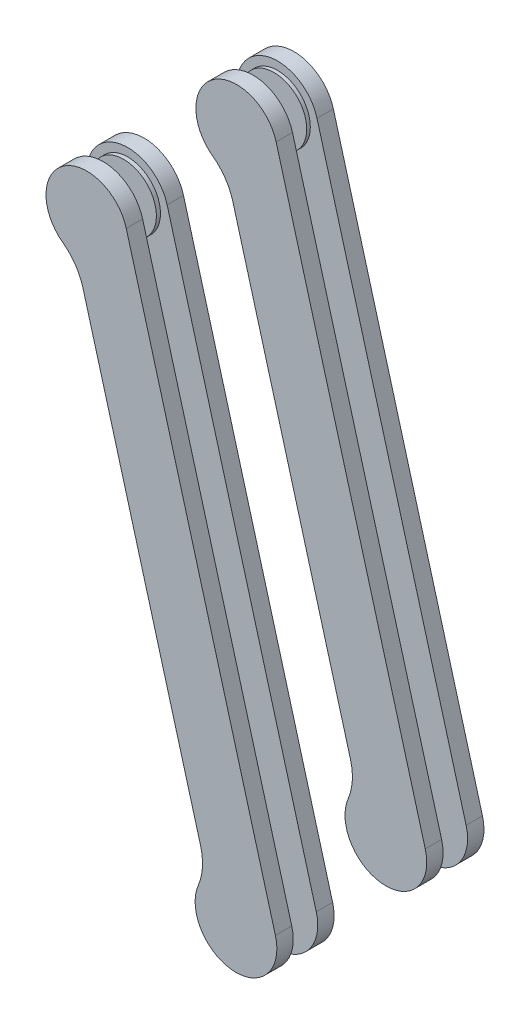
ISO-10303-21;
HEADER;
FILE_DESCRIPTION(('STEP AP214'),'2;1');
FILE_NAME('part.step','',(''),(''),'','','');
FILE_SCHEMA(('AUTOMOTIVE_DESIGN { 1 0 10303 214 1 1 1 1 }'));
ENDSEC;
DATA;
#1=APPLICATION_CONTEXT('core data for automotive mechanical design processes');
#2=APPLICATION_PROTOCOL_DEFINITION('international standard','automotive_design',2000,#1);
#3=PRODUCT_CONTEXT('',#1,'mechanical');
#4=PRODUCT('Part','Part','',(#3));
#5=PRODUCT_RELATED_PRODUCT_CATEGORY('part','',(#4));
#6=PRODUCT_DEFINITION_FORMATION('','',#4);
#7=PRODUCT_DEFINITION_CONTEXT('part definition',#1,'design');
#8=PRODUCT_DEFINITION('design','',#6,#7);
#9=PRODUCT_DEFINITION_SHAPE('','',#8);
#10=(LENGTH_UNIT() NAMED_UNIT(*) SI_UNIT(.MILLI.,.METRE.));
#11=(NAMED_UNIT(*) PLANE_ANGLE_UNIT() SI_UNIT($,.RADIAN.));
#12=(NAMED_UNIT(*) SI_UNIT($,.STERADIAN.) SOLID_ANGLE_UNIT());
#13=UNCERTAINTY_MEASURE_WITH_UNIT(LENGTH_MEASURE(1.E-05),#10,'distance_accuracy_value','');
#14=(GEOMETRIC_REPRESENTATION_CONTEXT(3) GLOBAL_UNCERTAINTY_ASSIGNED_CONTEXT((#13)) GLOBAL_UNIT_ASSIGNED_CONTEXT((#10,
#11,#12)) REPRESENTATION_CONTEXT('',''));
#15=CARTESIAN_POINT('',(0.,0.,0.));
#16=DIRECTION('',(0.,0.,1.));
#17=DIRECTION('',(1.,0.,0.));
#18=AXIS2_PLACEMENT_3D('',#15,#16,#17);
#19=CARTESIAN_POINT('',(189.457124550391,500.064001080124,22.9999999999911));
#20=DIRECTION('',(0.,0.,-1.));
#21=DIRECTION('',(-1.,0.,0.));
#22=AXIS2_PLACEMENT_3D('',#19,#20,#21);
#23=PLANE('',#22);
#24=CARTESIAN_POINT('',(189.457124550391,500.064001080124,22.9999999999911));
#25=DIRECTION('',(0.,0.,1.));
#26=DIRECTION('',(1.,0.,0.));
#27=AXIS2_PLACEMENT_3D('',#24,#25,#26);
#28=CIRCLE('',#27,12.0000004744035);
#29=CARTESIAN_POINT('',(201.457125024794,500.064001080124,22.9999999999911));
#30=VERTEX_POINT('',#29);
#31=EDGE_CURVE('P0_E10',#30,#30,#28,.T.);
#32=ORIENTED_EDGE('',*,*,#31,.F.);
#33=EDGE_LOOP('',(#32));
#34=FACE_BOUND('',#33,.T.);
#35=ADVANCED_FACE('P0_F14',(#34),#23,.T.);
#36=CARTESIAN_POINT('',(189.457124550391,500.064001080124,24.4999999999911));
#37=DIRECTION('',(0.,0.,1.));
#38=DIRECTION('',(1.,0.,0.));
#39=AXIS2_PLACEMENT_3D('',#36,#37,#38);
#40=PLANE('',#39);
#41=CARTESIAN_POINT('',(189.457124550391,500.064001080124,24.4999999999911));
#42=DIRECTION('',(0.,0.,-1.));
#43=DIRECTION('',(-1.,0.,0.));
#44=AXIS2_PLACEMENT_3D('',#41,#42,#43);
#45=CIRCLE('',#44,12.0000004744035);
#46=CARTESIAN_POINT('',(177.457124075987,500.064001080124,24.4999999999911));
#47=VERTEX_POINT('',#46);
#48=EDGE_CURVE('P0_E21',#47,#47,#45,.T.);
#49=ORIENTED_EDGE('',*,*,#48,.F.);
#50=EDGE_LOOP('',(#49));
#51=FACE_BOUND('',#50,.T.);
#52=ADVANCED_FACE('P0_F28',(#51),#40,.T.);
#53=CARTESIAN_POINT('',(189.457124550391,500.064001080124,24.4999999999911));
#54=DIRECTION('',(0.,0.,-1.));
#55=DIRECTION('',(-1.,0.,0.));
#56=AXIS2_PLACEMENT_3D('',#53,#54,#55);
#57=CYLINDRICAL_SURFACE('',#56,12.0000004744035);
#58=ORIENTED_EDGE('',*,*,#31,.T.);
#59=EDGE_LOOP('',(#58));
#60=FACE_BOUND('',#59,.T.);
#61=ORIENTED_EDGE('',*,*,#48,.T.);
#62=EDGE_LOOP('',(#61));
#63=FACE_BOUND('',#62,.T.);
#64=ADVANCED_FACE('P0_F16',(#60,#63),#57,.T.);
#65=CLOSED_SHELL('',(#35,#52,#64));
#66=MANIFOLD_SOLID_BREP('P0_B1',#65);
#67=CARTESIAN_POINT('',(189.457124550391,500.064001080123,-30.6777586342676));
#68=DIRECTION('',(0.,0.,1.));
#69=DIRECTION('',(1.,0.,0.));
#70=AXIS2_PLACEMENT_3D('',#67,#68,#69);
#71=PLANE('',#70);
#72=CARTESIAN_POINT('',(189.457124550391,500.064001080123,-30.6777586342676));
#73=DIRECTION('',(0.,0.,-1.));
#74=DIRECTION('',(-1.,0.,0.));
#75=AXIS2_PLACEMENT_3D('',#72,#73,#74);
#76=CIRCLE('',#75,12.0000004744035);
#77=CARTESIAN_POINT('',(177.457124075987,500.064001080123,-30.6777586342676));
#78=VERTEX_POINT('',#77);
#79=EDGE_CURVE('P1_E10',#78,#78,#76,.T.);
#80=ORIENTED_EDGE('',*,*,#79,.F.);
#81=EDGE_LOOP('',(#80));
#82=FACE_BOUND('',#81,.T.);
#83=ADVANCED_FACE('P1_F14',(#82),#71,.T.);
#84=CARTESIAN_POINT('',(189.457124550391,500.064001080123,-32.1777586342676));
#85=DIRECTION('',(0.,0.,-1.));
#86=DIRECTION('',(-1.,0.,0.));
#87=AXIS2_PLACEMENT_3D('',#84,#85,#86);
#88=PLANE('',#87);
#89=CARTESIAN_POINT('',(189.457124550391,500.064001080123,-32.1777586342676));
#90=DIRECTION('',(0.,0.,1.));
#91=DIRECTION('',(1.,0.,0.));
#92=AXIS2_PLACEMENT_3D('',#89,#90,#91);
#93=CIRCLE('',#92,12.0000004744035);
#94=CARTESIAN_POINT('',(201.457125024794,500.064001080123,-32.1777586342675));
#95=VERTEX_POINT('',#94);
#96=EDGE_CURVE('P1_E21',#95,#95,#93,.T.);
#97=ORIENTED_EDGE('',*,*,#96,.F.);
#98=EDGE_LOOP('',(#97));
#99=FACE_BOUND('',#98,.T.);
#100=ADVANCED_FACE('P1_F28',(#99),#88,.T.);
#101=CARTESIAN_POINT('',(189.457124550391,500.064001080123,-32.1777586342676));
#102=DIRECTION('',(0.,0.,1.));
#103=DIRECTION('',(1.,0.,0.));
#104=AXIS2_PLACEMENT_3D('',#101,#102,#103);
#105=CYLINDRICAL_SURFACE('',#104,12.0000004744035);
#106=ORIENTED_EDGE('',*,*,#79,.T.);
#107=EDGE_LOOP('',(#106));
#108=FACE_BOUND('',#107,.T.);
#109=ORIENTED_EDGE('',*,*,#96,.T.);
#110=EDGE_LOOP('',(#109));
#111=FACE_BOUND('',#110,.T.);
#112=ADVANCED_FACE('P1_F16',(#108,#111),#105,.T.);
#113=CLOSED_SHELL('',(#83,#100,#112));
#114=MANIFOLD_SOLID_BREP('P1_B1',#113);
#115=CARTESIAN_POINT('',(258.640039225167,306.734149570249,16.9999993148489));
#116=DIRECTION('',(0.963628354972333,0.267245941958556,-2.71115585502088E-13));
#117=DIRECTION('',(-0.267245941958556,0.963628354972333,0.));
#118=AXIS2_PLACEMENT_3D('',#115,#116,#117);
#119=PLANE('',#118);
#120=DIRECTION('',(-0.267245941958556,0.963628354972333,0.));
#121=VECTOR('',#120,1.);
#122=CARTESIAN_POINT('',(258.640039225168,306.734149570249,22.9999993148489));
#123=LINE('',#122,#121);
#124=CARTESIAN_POINT('',(258.640039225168,306.734149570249,22.9999993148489));
#125=VERTEX_POINT('',#124);
#126=CARTESIAN_POINT('',(203.911549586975,504.072691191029,22.9999993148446));
#127=VERTEX_POINT('',#126);
#128=EDGE_CURVE('P2_E110',#125,#127,#123,.T.);
#129=ORIENTED_EDGE('',*,*,#128,.F.);
#130=DIRECTION('',(2.55680513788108E-13,0.,1.));
#131=VECTOR('',#130,1.);
#132=CARTESIAN_POINT('',(258.640039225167,306.734149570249,16.9999993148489));
#133=LINE('',#132,#131);
#134=CARTESIAN_POINT('',(258.640039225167,306.734149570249,16.9999993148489));
#135=VERTEX_POINT('',#134);
#136=EDGE_CURVE('P2_E55',#135,#125,#133,.T.);
#137=ORIENTED_EDGE('',*,*,#136,.F.);
#138=DIRECTION('',(-0.267245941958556,0.963628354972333,0.));
#139=VECTOR('',#138,1.);
#140=CARTESIAN_POINT('',(258.640039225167,306.734149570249,16.9999993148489));
#141=LINE('',#140,#139);
#142=CARTESIAN_POINT('',(203.911549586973,504.072691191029,16.9999993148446));
#143=VERTEX_POINT('',#142);
#144=EDGE_CURVE('P2_E94',#135,#143,#141,.T.);
#145=ORIENTED_EDGE('',*,*,#144,.T.);
#146=DIRECTION('',(2.55680513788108E-13,0.,1.));
#147=VECTOR('',#146,1.);
#148=CARTESIAN_POINT('',(203.911549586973,504.072691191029,16.9999993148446));
#149=LINE('',#148,#147);
#150=EDGE_CURVE('P2_E11',#143,#127,#149,.T.);
#151=ORIENTED_EDGE('',*,*,#150,.T.);
#152=EDGE_LOOP('',(#129,#137,#145,#151));
#153=FACE_BOUND('',#152,.T.);
#154=ADVANCED_FACE('P2_F16',(#153),#119,.T.);
#155=CARTESIAN_POINT('',(189.457124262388,500.064002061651,16.9999993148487));
#156=DIRECTION('',(2.55680513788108E-13,0.,1.));
#157=DIRECTION('',(1.,0.,-2.55680513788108E-13));
#158=AXIS2_PLACEMENT_3D('',#155,#156,#157);
#159=CYLINDRICAL_SURFACE('',#158,15.);
#160=CARTESIAN_POINT('',(189.45712426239,500.064002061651,22.9999993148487));
#161=DIRECTION('',(2.55680513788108E-13,0.,1.));
#162=DIRECTION('',(-1.,0.,2.55680513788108E-13));
#163=AXIS2_PLACEMENT_3D('',#160,#161,#162);
#164=CIRCLE('',#163,15.);
#165=CARTESIAN_POINT('',(180.579809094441,487.972960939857,22.9999993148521));
#166=VERTEX_POINT('',#165);
#167=EDGE_CURVE('P2_E113',#127,#166,#164,.T.);
#168=ORIENTED_EDGE('',*,*,#167,.F.);
#169=ORIENTED_EDGE('',*,*,#150,.F.);
#170=CARTESIAN_POINT('',(189.457124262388,500.064002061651,16.9999993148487));
#171=DIRECTION('',(2.55680513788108E-13,0.,1.));
#172=DIRECTION('',(-1.,0.,2.55680513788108E-13));
#173=AXIS2_PLACEMENT_3D('',#170,#171,#172);
#174=CIRCLE('',#173,15.);
#175=CARTESIAN_POINT('',(180.57980909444,487.972960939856,16.9999993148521));
#176=VERTEX_POINT('',#175);
#177=EDGE_CURVE('P2_E96',#143,#176,#174,.T.);
#178=ORIENTED_EDGE('',*,*,#177,.T.);
#179=DIRECTION('',(2.55680513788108E-13,0.,1.));
#180=VECTOR('',#179,1.);
#181=CARTESIAN_POINT('',(180.57980909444,487.972960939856,16.9999993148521));
#182=LINE('',#181,#180);
#183=EDGE_CURVE('P2_E20',#176,#166,#182,.T.);
#184=ORIENTED_EDGE('',*,*,#183,.T.);
#185=EDGE_LOOP('',(#168,#169,#178,#184));
#186=FACE_BOUND('',#185,.T.);
#187=ADVANCED_FACE('P2_F120',(#186),#159,.T.);
#188=CARTESIAN_POINT('',(168.743388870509,471.851572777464,16.9999993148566));
#189=DIRECTION('',(2.55680513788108E-13,0.,1.));
#190=DIRECTION('',(1.,0.,-2.55680513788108E-13));
#191=AXIS2_PLACEMENT_3D('',#188,#189,#190);
#192=CYLINDRICAL_SURFACE('',#191,20.);
#193=CARTESIAN_POINT('',(168.743388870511,471.851572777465,22.9999993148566));
#194=DIRECTION('',(-2.55680513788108E-13,0.,-1.));
#195=DIRECTION('',(-1.,0.,2.55680513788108E-13));
#196=AXIS2_PLACEMENT_3D('',#193,#194,#195);
#197=CIRCLE('',#196,20.);
#198=CARTESIAN_POINT('',(188.015955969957,477.196491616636,22.9999993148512));
#199=VERTEX_POINT('',#198);
#200=EDGE_CURVE('P2_E101',#166,#199,#197,.T.);
#201=ORIENTED_EDGE('',*,*,#200,.F.);
#202=ORIENTED_EDGE('',*,*,#183,.F.);
#203=CARTESIAN_POINT('',(168.743388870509,471.851572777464,16.9999993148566));
#204=DIRECTION('',(-2.55680513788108E-13,0.,-1.));
#205=DIRECTION('',(-1.,0.,2.55680513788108E-13));
#206=AXIS2_PLACEMENT_3D('',#203,#204,#205);
#207=CIRCLE('',#206,20.);
#208=CARTESIAN_POINT('',(188.015955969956,477.196491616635,16.9999993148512));
#209=VERTEX_POINT('',#208);
#210=EDGE_CURVE('P2_E115',#176,#209,#207,.T.);
#211=ORIENTED_EDGE('',*,*,#210,.T.);
#212=DIRECTION('',(2.55680513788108E-13,0.,1.));
#213=VECTOR('',#212,1.);
#214=CARTESIAN_POINT('',(188.015955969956,477.196491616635,16.9999993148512));
#215=LINE('',#214,#213);
#216=EDGE_CURVE('P2_E118',#209,#199,#215,.T.);
#217=ORIENTED_EDGE('',*,*,#216,.T.);
#218=EDGE_LOOP('',(#201,#202,#211,#217));
#219=FACE_BOUND('',#218,.T.);
#220=ADVANCED_FACE('P2_F18',(#219),#192,.F.);
#221=CARTESIAN_POINT('',(188.015955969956,477.196491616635,16.9999993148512));
#222=DIRECTION('',(-0.963628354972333,-0.267245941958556,2.71115585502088E-13));
#223=DIRECTION('',(0.267245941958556,-0.963628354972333,0.));
#224=AXIS2_PLACEMENT_3D('',#221,#222,#223);
#225=PLANE('',#224);
#226=DIRECTION('',(0.267245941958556,-0.963628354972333,0.));
#227=VECTOR('',#226,1.);
#228=CARTESIAN_POINT('',(188.015955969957,477.196491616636,22.9999993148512));
#229=LINE('',#228,#227);
#230=CARTESIAN_POINT('',(231.172356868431,321.584281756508,22.9999993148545));
#231=VERTEX_POINT('',#230);
#232=EDGE_CURVE('P2_E104',#199,#231,#229,.T.);
#233=ORIENTED_EDGE('',*,*,#232,.F.);
#234=ORIENTED_EDGE('',*,*,#216,.F.);
#235=DIRECTION('',(0.267245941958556,-0.963628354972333,0.));
#236=VECTOR('',#235,1.);
#237=CARTESIAN_POINT('',(188.015955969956,477.196491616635,16.9999993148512));
#238=LINE('',#237,#236);
#239=CARTESIAN_POINT('',(231.172356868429,321.584281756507,16.9999993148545));
#240=VERTEX_POINT('',#239);
#241=EDGE_CURVE('P2_E91',#209,#240,#238,.T.);
#242=ORIENTED_EDGE('',*,*,#241,.T.);
#243=DIRECTION('',(2.55680513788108E-13,0.,1.));
#244=VECTOR('',#243,1.);
#245=CARTESIAN_POINT('',(231.172356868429,321.584281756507,16.9999993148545));
#246=LINE('',#245,#244);
#247=EDGE_CURVE('P2_E83',#240,#231,#246,.T.);
#248=ORIENTED_EDGE('',*,*,#247,.T.);
#249=EDGE_LOOP('',(#233,#234,#242,#248));
#250=FACE_BOUND('',#249,.T.);
#251=ADVANCED_FACE('P2_F136',(#250),#225,.T.);
#252=CARTESIAN_POINT('',(211.899789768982,316.239362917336,16.99999931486));
#253=DIRECTION('',(2.55680513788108E-13,0.,1.));
#254=DIRECTION('',(1.,0.,-2.55680513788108E-13));
#255=AXIS2_PLACEMENT_3D('',#252,#253,#254);
#256=CYLINDRICAL_SURFACE('',#255,20.);
#257=CARTESIAN_POINT('',(211.899789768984,316.239362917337,22.99999931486));
#258=DIRECTION('',(-2.55680513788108E-13,0.,-1.));
#259=DIRECTION('',(-1.,0.,2.55680513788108E-13));
#260=AXIS2_PLACEMENT_3D('',#257,#258,#259);
#261=CIRCLE('',#260,20.);
#262=CARTESIAN_POINT('',(230.348832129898,308.517132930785,22.999999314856));
#263=VERTEX_POINT('',#262);
#264=EDGE_CURVE('P2_E107',#231,#263,#261,.T.);
#265=ORIENTED_EDGE('',*,*,#264,.F.);
#266=ORIENTED_EDGE('',*,*,#247,.F.);
#267=CARTESIAN_POINT('',(211.899789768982,316.239362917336,16.99999931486));
#268=DIRECTION('',(-2.55680513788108E-13,0.,-1.));
#269=DIRECTION('',(-1.,0.,2.55680513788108E-13));
#270=AXIS2_PLACEMENT_3D('',#267,#268,#269);
#271=CIRCLE('',#270,20.);
#272=CARTESIAN_POINT('',(230.348832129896,308.517132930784,16.999999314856));
#273=VERTEX_POINT('',#272);
#274=EDGE_CURVE('P2_E86',#240,#273,#271,.T.);
#275=ORIENTED_EDGE('',*,*,#274,.T.);
#276=DIRECTION('',(2.55680513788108E-13,0.,1.));
#277=VECTOR('',#276,1.);
#278=CARTESIAN_POINT('',(230.348832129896,308.517132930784,16.999999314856));
#279=LINE('',#278,#277);
#280=EDGE_CURVE('P2_E73',#273,#263,#279,.T.);
#281=ORIENTED_EDGE('',*,*,#280,.T.);
#282=EDGE_LOOP('',(#265,#266,#275,#281));
#283=FACE_BOUND('',#282,.T.);
#284=ADVANCED_FACE('P2_F87',(#283),#256,.F.);
#285=CARTESIAN_POINT('',(244.185613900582,302.72546044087,16.999999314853));
#286=DIRECTION('',(2.55680513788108E-13,0.,1.));
#287=DIRECTION('',(1.,0.,-2.55680513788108E-13));
#288=AXIS2_PLACEMENT_3D('',#285,#286,#287);
#289=CYLINDRICAL_SURFACE('',#288,15.);
#290=CARTESIAN_POINT('',(244.185613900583,302.725460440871,22.999999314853));
#291=DIRECTION('',(2.55680513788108E-13,0.,1.));
#292=DIRECTION('',(-1.,0.,2.55680513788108E-13));
#293=AXIS2_PLACEMENT_3D('',#290,#291,#292);
#294=CIRCLE('',#293,15.);
#295=EDGE_CURVE('P2_E79',#263,#125,#294,.T.);
#296=ORIENTED_EDGE('',*,*,#295,.F.);
#297=ORIENTED_EDGE('',*,*,#280,.F.);
#298=CARTESIAN_POINT('',(244.185613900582,302.72546044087,16.999999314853));
#299=DIRECTION('',(2.55680513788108E-13,0.,1.));
#300=DIRECTION('',(-1.,0.,2.55680513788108E-13));
#301=AXIS2_PLACEMENT_3D('',#298,#299,#300);
#302=CIRCLE('',#301,15.);
#303=EDGE_CURVE('P2_E77',#273,#135,#302,.T.);
#304=ORIENTED_EDGE('',*,*,#303,.T.);
#305=ORIENTED_EDGE('',*,*,#136,.T.);
#306=EDGE_LOOP('',(#296,#297,#304,#305));
#307=FACE_BOUND('',#306,.T.);
#308=ADVANCED_FACE('P2_F75',(#307),#289,.T.);
#309=CARTESIAN_POINT('',(216.821369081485,401.39473125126,16.9999993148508));
#310=DIRECTION('',(2.55682382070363E-13,0.,1.));
#311=DIRECTION('',(1.,0.,-2.55682382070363E-13));
#312=AXIS2_PLACEMENT_3D('',#309,#310,#311);
#313=PLANE('',#312);
#314=ORIENTED_EDGE('',*,*,#144,.F.);
#315=ORIENTED_EDGE('',*,*,#303,.F.);
#316=ORIENTED_EDGE('',*,*,#274,.F.);
#317=ORIENTED_EDGE('',*,*,#241,.F.);
#318=ORIENTED_EDGE('',*,*,#210,.F.);
#319=ORIENTED_EDGE('',*,*,#177,.F.);
#320=EDGE_LOOP('',(#314,#315,#316,#317,#318,#319));
#321=FACE_BOUND('',#320,.T.);
#322=ADVANCED_FACE('P2_F93',(#321),#313,.F.);
#323=CARTESIAN_POINT('',(216.821369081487,401.394731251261,22.9999993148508));
#324=DIRECTION('',(2.55682382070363E-13,0.,1.));
#325=DIRECTION('',(1.,0.,-2.55682382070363E-13));
#326=AXIS2_PLACEMENT_3D('',#323,#324,#325);
#327=PLANE('',#326);
#328=ORIENTED_EDGE('',*,*,#128,.T.);
#329=ORIENTED_EDGE('',*,*,#167,.T.);
#330=ORIENTED_EDGE('',*,*,#200,.T.);
#331=ORIENTED_EDGE('',*,*,#232,.T.);
#332=ORIENTED_EDGE('',*,*,#264,.T.);
#333=ORIENTED_EDGE('',*,*,#295,.T.);
#334=EDGE_LOOP('',(#328,#329,#330,#331,#332,#333));
#335=FACE_BOUND('',#334,.T.);
#336=ADVANCED_FACE('P2_F123',(#335),#327,.T.);
#337=CLOSED_SHELL('',(#154,#187,#220,#251,#284,#308,#322,#336));
#338=MANIFOLD_SOLID_BREP('P2_B1',#337);
#339=CARTESIAN_POINT('',(189.457124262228,500.064002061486,31.9999993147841));
#340=DIRECTION('',(1.68826918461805E-12,4.89436501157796E-13,1.));
#341=DIRECTION('',(1.,0.,-1.68826918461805E-12));
#342=AXIS2_PLACEMENT_3D('',#339,#340,#341);
#343=CYLINDRICAL_SURFACE('',#342,15.);
#344=CARTESIAN_POINT('',(189.457124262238,500.064002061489,37.9999993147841));
#345=DIRECTION('',(1.68826918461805E-12,4.89436501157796E-13,1.));
#346=DIRECTION('',(-1.,0.,1.68826918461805E-12));
#347=AXIS2_PLACEMENT_3D('',#344,#345,#346);
#348=CIRCLE('',#347,15.);
#349=CARTESIAN_POINT('',(203.911549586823,504.072691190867,37.9999993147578));
#350=VERTEX_POINT('',#349);
#351=CARTESIAN_POINT('',(180.57980909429,487.972960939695,37.9999993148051));
#352=VERTEX_POINT('',#351);
#353=EDGE_CURVE('P3_E110',#350,#352,#348,.T.);
#354=ORIENTED_EDGE('',*,*,#353,.F.);
#355=DIRECTION('',(1.68826918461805E-12,4.89436501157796E-13,1.));
#356=VECTOR('',#355,1.);
#357=CARTESIAN_POINT('',(203.911549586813,504.072691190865,31.9999993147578));
#358=LINE('',#357,#356);
#359=CARTESIAN_POINT('',(203.911549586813,504.072691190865,31.9999993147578));
#360=VERTEX_POINT('',#359);
#361=EDGE_CURVE('P3_E55',#360,#350,#358,.T.);
#362=ORIENTED_EDGE('',*,*,#361,.F.);
#363=CARTESIAN_POINT('',(189.457124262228,500.064002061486,31.9999993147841));
#364=DIRECTION('',(1.68826918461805E-12,4.89436501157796E-13,1.));
#365=DIRECTION('',(-1.,0.,1.68826918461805E-12));
#366=AXIS2_PLACEMENT_3D('',#363,#364,#365);
#367=CIRCLE('',#366,15.);
#368=CARTESIAN_POINT('',(180.57980909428,487.972960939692,31.9999993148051));
#369=VERTEX_POINT('',#368);
#370=EDGE_CURVE('P3_E94',#360,#369,#367,.T.);
#371=ORIENTED_EDGE('',*,*,#370,.T.);
#372=DIRECTION('',(1.68826918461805E-12,4.89436501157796E-13,1.));
#373=VECTOR('',#372,1.);
#374=CARTESIAN_POINT('',(180.57980909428,487.972960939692,31.9999993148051));
#375=LINE('',#374,#373);
#376=EDGE_CURVE('P3_E11',#369,#352,#375,.T.);
#377=ORIENTED_EDGE('',*,*,#376,.T.);
#378=EDGE_LOOP('',(#354,#362,#371,#377));
#379=FACE_BOUND('',#378,.T.);
#380=ADVANCED_FACE('P3_F16',(#379),#343,.T.);
#381=CARTESIAN_POINT('',(168.743388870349,471.8515727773,31.9999993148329));
#382=DIRECTION('',(1.68826918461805E-12,4.89436501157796E-13,1.));
#383=DIRECTION('',(1.,0.,-1.68826918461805E-12));
#384=AXIS2_PLACEMENT_3D('',#381,#382,#383);
#385=CYLINDRICAL_SURFACE('',#384,20.);
#386=CARTESIAN_POINT('',(168.743388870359,471.851572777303,37.9999993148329));
#387=DIRECTION('',(-1.68826918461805E-12,-4.89436501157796E-13,-1.));
#388=DIRECTION('',(-1.,0.,1.68826918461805E-12));
#389=AXIS2_PLACEMENT_3D('',#386,#387,#388);
#390=CIRCLE('',#389,20.);
#391=CARTESIAN_POINT('',(188.015955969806,477.196491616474,37.9999993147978));
#392=VERTEX_POINT('',#391);
#393=EDGE_CURVE('P3_E113',#352,#392,#390,.T.);
#394=ORIENTED_EDGE('',*,*,#393,.F.);
#395=ORIENTED_EDGE('',*,*,#376,.F.);
#396=CARTESIAN_POINT('',(168.743388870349,471.8515727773,31.9999993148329));
#397=DIRECTION('',(-1.68826918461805E-12,-4.89436501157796E-13,-1.));
#398=DIRECTION('',(-1.,0.,1.68826918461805E-12));
#399=AXIS2_PLACEMENT_3D('',#396,#397,#398);
#400=CIRCLE('',#399,20.);
#401=CARTESIAN_POINT('',(188.015955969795,477.196491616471,31.9999993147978));
#402=VERTEX_POINT('',#401);
#403=EDGE_CURVE('P3_E96',#369,#402,#400,.T.);
#404=ORIENTED_EDGE('',*,*,#403,.T.);
#405=DIRECTION('',(1.68826918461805E-12,4.89436501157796E-13,1.));
#406=VECTOR('',#405,1.);
#407=CARTESIAN_POINT('',(188.015955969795,477.196491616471,31.9999993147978));
#408=LINE('',#407,#406);
#409=EDGE_CURVE('P3_E20',#402,#392,#408,.T.);
#410=ORIENTED_EDGE('',*,*,#409,.T.);
#411=EDGE_LOOP('',(#394,#395,#404,#410));
#412=FACE_BOUND('',#411,.T.);
#413=ADVANCED_FACE('P3_F120',(#412),#385,.F.);
#414=CARTESIAN_POINT('',(236.958401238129,300.721115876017,31.9999993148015));
#415=DIRECTION('',(-0.963628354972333,-0.267245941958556,1.75766397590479E-12));
#416=DIRECTION('',(0.267245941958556,-0.963628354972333,0.));
#417=AXIS2_PLACEMENT_3D('',#414,#415,#416);
#418=PLANE('',#417);
#419=DIRECTION('',(0.267245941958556,-0.963628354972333,0.));
#420=VECTOR('',#419,1.);
#421=CARTESIAN_POINT('',(236.958401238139,300.72111587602,37.9999993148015));
#422=LINE('',#421,#420);
#423=CARTESIAN_POINT('',(231.172356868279,321.584281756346,37.9999993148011));
#424=VERTEX_POINT('',#423);
#425=EDGE_CURVE('P3_E101',#392,#424,#422,.T.);
#426=ORIENTED_EDGE('',*,*,#425,.F.);
#427=ORIENTED_EDGE('',*,*,#409,.F.);
#428=DIRECTION('',(0.267245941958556,-0.963628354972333,0.));
#429=VECTOR('',#428,1.);
#430=CARTESIAN_POINT('',(236.958401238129,300.721115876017,31.9999993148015));
#431=LINE('',#430,#429);
#432=CARTESIAN_POINT('',(231.172356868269,321.584281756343,31.9999993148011));
#433=VERTEX_POINT('',#432);
#434=EDGE_CURVE('P3_E115',#402,#433,#431,.T.);
#435=ORIENTED_EDGE('',*,*,#434,.T.);
#436=DIRECTION('',(1.68826918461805E-12,4.89436501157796E-13,1.));
#437=VECTOR('',#436,1.);
#438=CARTESIAN_POINT('',(231.172356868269,321.584281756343,31.9999993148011));
#439=LINE('',#438,#437);
#440=EDGE_CURVE('P3_E118',#433,#424,#439,.T.);
#441=ORIENTED_EDGE('',*,*,#440,.T.);
#442=EDGE_LOOP('',(#426,#427,#435,#441));
#443=FACE_BOUND('',#442,.T.);
#444=ADVANCED_FACE('P3_F18',(#443),#418,.T.);
#445=CARTESIAN_POINT('',(211.899789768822,316.239362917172,31.9999993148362));
#446=DIRECTION('',(1.68826918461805E-12,4.89436501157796E-13,1.));
#447=DIRECTION('',(1.,0.,-1.68826918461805E-12));
#448=AXIS2_PLACEMENT_3D('',#445,#446,#447);
#449=CYLINDRICAL_SURFACE('',#448,20.);
#450=CARTESIAN_POINT('',(211.899789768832,316.239362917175,37.9999993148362));
#451=DIRECTION('',(-1.68826918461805E-12,-4.89436501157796E-13,-1.));
#452=DIRECTION('',(-1.,0.,1.68826918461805E-12));
#453=AXIS2_PLACEMENT_3D('',#450,#451,#452);
#454=CIRCLE('',#453,20.);
#455=CARTESIAN_POINT('',(230.348832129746,308.517132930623,37.9999993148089));
#456=VERTEX_POINT('',#455);
#457=EDGE_CURVE('P3_E104',#424,#456,#454,.T.);
#458=ORIENTED_EDGE('',*,*,#457,.F.);
#459=ORIENTED_EDGE('',*,*,#440,.F.);
#460=CARTESIAN_POINT('',(211.899789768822,316.239362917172,31.9999993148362));
#461=DIRECTION('',(-1.68826918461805E-12,-4.89436501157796E-13,-1.));
#462=DIRECTION('',(-1.,0.,1.68826918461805E-12));
#463=AXIS2_PLACEMENT_3D('',#460,#461,#462);
#464=CIRCLE('',#463,20.);
#465=CARTESIAN_POINT('',(230.348832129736,308.51713293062,31.9999993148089));
#466=VERTEX_POINT('',#465);
#467=EDGE_CURVE('P3_E91',#433,#466,#464,.T.);
#468=ORIENTED_EDGE('',*,*,#467,.T.);
#469=DIRECTION('',(1.68826918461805E-12,4.89436501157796E-13,1.));
#470=VECTOR('',#469,1.);
#471=CARTESIAN_POINT('',(230.348832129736,308.51713293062,31.9999993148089));
#472=LINE('',#471,#470);
#473=EDGE_CURVE('P3_E83',#466,#456,#472,.T.);
#474=ORIENTED_EDGE('',*,*,#473,.T.);
#475=EDGE_LOOP('',(#458,#459,#468,#474));
#476=FACE_BOUND('',#475,.T.);
#477=ADVANCED_FACE('P3_F136',(#476),#449,.F.);
#478=CARTESIAN_POINT('',(244.185613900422,302.725460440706,31.9999993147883));
#479=DIRECTION('',(1.68826918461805E-12,4.89436501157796E-13,1.));
#480=DIRECTION('',(1.,0.,-1.68826918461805E-12));
#481=AXIS2_PLACEMENT_3D('',#478,#479,#480);
#482=CYLINDRICAL_SURFACE('',#481,15.);
#483=CARTESIAN_POINT('',(244.185613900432,302.725460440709,37.9999993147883));
#484=DIRECTION('',(1.68826918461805E-12,4.89436501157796E-13,1.));
#485=DIRECTION('',(-1.,0.,1.68826918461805E-12));
#486=AXIS2_PLACEMENT_3D('',#483,#484,#485);
#487=CIRCLE('',#486,15.);
#488=CARTESIAN_POINT('',(258.640039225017,306.734149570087,37.999999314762));
#489=VERTEX_POINT('',#488);
#490=EDGE_CURVE('P3_E107',#456,#489,#487,.T.);
#491=ORIENTED_EDGE('',*,*,#490,.F.);
#492=ORIENTED_EDGE('',*,*,#473,.F.);
#493=CARTESIAN_POINT('',(244.185613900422,302.725460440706,31.9999993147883));
#494=DIRECTION('',(1.68826918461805E-12,4.89436501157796E-13,1.));
#495=DIRECTION('',(-1.,0.,1.68826918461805E-12));
#496=AXIS2_PLACEMENT_3D('',#493,#494,#495);
#497=CIRCLE('',#496,15.);
#498=CARTESIAN_POINT('',(258.640039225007,306.734149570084,31.999999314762));
#499=VERTEX_POINT('',#498);
#500=EDGE_CURVE('P3_E86',#466,#499,#497,.T.);
#501=ORIENTED_EDGE('',*,*,#500,.T.);
#502=DIRECTION('',(1.68826918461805E-12,4.89436501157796E-13,1.));
#503=VECTOR('',#502,1.);
#504=CARTESIAN_POINT('',(258.640039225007,306.734149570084,31.999999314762));
#505=LINE('',#504,#503);
#506=EDGE_CURVE('P3_E73',#499,#489,#505,.T.);
#507=ORIENTED_EDGE('',*,*,#506,.T.);
#508=EDGE_LOOP('',(#491,#492,#501,#507));
#509=FACE_BOUND('',#508,.T.);
#510=ADVANCED_FACE('P3_F87',(#509),#482,.T.);
#511=CARTESIAN_POINT('',(203.911549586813,504.072691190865,31.9999993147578));
#512=DIRECTION('',(0.963628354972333,0.267245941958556,-1.75766397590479E-12));
#513=DIRECTION('',(-0.267245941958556,0.963628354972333,0.));
#514=AXIS2_PLACEMENT_3D('',#511,#512,#513);
#515=PLANE('',#514);
#516=DIRECTION('',(-0.267245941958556,0.963628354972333,0.));
#517=VECTOR('',#516,1.);
#518=CARTESIAN_POINT('',(203.911549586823,504.072691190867,37.9999993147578));
#519=LINE('',#518,#517);
#520=EDGE_CURVE('P3_E79',#489,#350,#519,.T.);
#521=ORIENTED_EDGE('',*,*,#520,.F.);
#522=ORIENTED_EDGE('',*,*,#506,.F.);
#523=DIRECTION('',(-0.267245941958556,0.963628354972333,0.));
#524=VECTOR('',#523,1.);
#525=CARTESIAN_POINT('',(203.911549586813,504.072691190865,31.9999993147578));
#526=LINE('',#525,#524);
#527=EDGE_CURVE('P3_E77',#499,#360,#526,.T.);
#528=ORIENTED_EDGE('',*,*,#527,.T.);
#529=ORIENTED_EDGE('',*,*,#361,.T.);
#530=EDGE_LOOP('',(#521,#522,#528,#529));
#531=FACE_BOUND('',#530,.T.);
#532=ADVANCED_FACE('P3_F75',(#531),#515,.T.);
#533=CARTESIAN_POINT('',(216.821369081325,401.394731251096,31.9999993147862));
#534=DIRECTION('',(1.68825748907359E-12,4.89405120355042E-13,1.));
#535=DIRECTION('',(1.,0.,-1.68825748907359E-12));
#536=AXIS2_PLACEMENT_3D('',#533,#534,#535);
#537=PLANE('',#536);
#538=ORIENTED_EDGE('',*,*,#370,.F.);
#539=ORIENTED_EDGE('',*,*,#527,.F.);
#540=ORIENTED_EDGE('',*,*,#500,.F.);
#541=ORIENTED_EDGE('',*,*,#467,.F.);
#542=ORIENTED_EDGE('',*,*,#434,.F.);
#543=ORIENTED_EDGE('',*,*,#403,.F.);
#544=EDGE_LOOP('',(#538,#539,#540,#541,#542,#543));
#545=FACE_BOUND('',#544,.T.);
#546=ADVANCED_FACE('P3_F93',(#545),#537,.F.);
#547=CARTESIAN_POINT('',(216.821369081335,401.394731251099,37.9999993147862));
#548=DIRECTION('',(1.68825748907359E-12,4.89405120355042E-13,1.));
#549=DIRECTION('',(1.,0.,-1.68825748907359E-12));
#550=AXIS2_PLACEMENT_3D('',#547,#548,#549);
#551=PLANE('',#550);
#552=ORIENTED_EDGE('',*,*,#353,.T.);
#553=ORIENTED_EDGE('',*,*,#393,.T.);
#554=ORIENTED_EDGE('',*,*,#425,.T.);
#555=ORIENTED_EDGE('',*,*,#457,.T.);
#556=ORIENTED_EDGE('',*,*,#490,.T.);
#557=ORIENTED_EDGE('',*,*,#520,.T.);
#558=EDGE_LOOP('',(#552,#553,#554,#555,#556,#557));
#559=FACE_BOUND('',#558,.T.);
#560=ADVANCED_FACE('P3_F123',(#559),#551,.T.);
#561=CLOSED_SHELL('',(#380,#413,#444,#477,#510,#532,#546,#560));
#562=MANIFOLD_SOLID_BREP('P3_B1',#561);
#563=CARTESIAN_POINT('',(211.899789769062,316.239362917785,-38.0000006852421));
#564=DIRECTION('',(2.66000357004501E-13,0.,1.));
#565=DIRECTION('',(1.,0.,-2.66000357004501E-13));
#566=AXIS2_PLACEMENT_3D('',#563,#564,#565);
#567=CYLINDRICAL_SURFACE('',#566,20.);
#568=CARTESIAN_POINT('',(211.899789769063,316.239362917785,-32.0000006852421));
#569=DIRECTION('',(-2.66000357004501E-13,0.,-1.));
#570=DIRECTION('',(-1.,0.,2.66000357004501E-13));
#571=AXIS2_PLACEMENT_3D('',#568,#569,#570);
#572=CIRCLE('',#571,20.);
#573=CARTESIAN_POINT('',(231.17235686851,321.584281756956,-32.0000006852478));
#574=VERTEX_POINT('',#573);
#575=CARTESIAN_POINT('',(230.348832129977,308.517132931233,-32.0000006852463));
#576=VERTEX_POINT('',#575);
#577=EDGE_CURVE('P4_E110',#574,#576,#572,.T.);
#578=ORIENTED_EDGE('',*,*,#577,.F.);
#579=DIRECTION('',(2.66000357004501E-13,0.,1.));
#580=VECTOR('',#579,1.);
#581=CARTESIAN_POINT('',(231.172356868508,321.584281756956,-38.0000006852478));
#582=LINE('',#581,#580);
#583=CARTESIAN_POINT('',(231.172356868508,321.584281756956,-38.0000006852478));
#584=VERTEX_POINT('',#583);
#585=EDGE_CURVE('P4_E55',#584,#574,#582,.T.);
#586=ORIENTED_EDGE('',*,*,#585,.F.);
#587=CARTESIAN_POINT('',(211.899789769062,316.239362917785,-38.0000006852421));
#588=DIRECTION('',(-2.66000357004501E-13,0.,-1.));
#589=DIRECTION('',(-1.,0.,2.66000357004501E-13));
#590=AXIS2_PLACEMENT_3D('',#587,#588,#589);
#591=CIRCLE('',#590,20.);
#592=CARTESIAN_POINT('',(230.348832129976,308.517132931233,-38.0000006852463));
#593=VERTEX_POINT('',#592);
#594=EDGE_CURVE('P4_E94',#584,#593,#591,.T.);
#595=ORIENTED_EDGE('',*,*,#594,.T.);
#596=DIRECTION('',(2.66000357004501E-13,0.,1.));
#597=VECTOR('',#596,1.);
#598=CARTESIAN_POINT('',(230.348832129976,308.517132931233,-38.0000006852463));
#599=LINE('',#598,#597);
#600=EDGE_CURVE('P4_E11',#593,#576,#599,.T.);
#601=ORIENTED_EDGE('',*,*,#600,.T.);
#602=EDGE_LOOP('',(#578,#586,#595,#601));
#603=FACE_BOUND('',#602,.T.);
#604=ADVANCED_FACE('P4_F16',(#603),#567,.F.);
#605=CARTESIAN_POINT('',(244.185613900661,302.725460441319,-38.0000006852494));
#606=DIRECTION('',(2.66000357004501E-13,0.,1.));
#607=DIRECTION('',(1.,0.,-2.66000357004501E-13));
#608=AXIS2_PLACEMENT_3D('',#605,#606,#607);
#609=CYLINDRICAL_SURFACE('',#608,15.);
#610=CARTESIAN_POINT('',(244.185613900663,302.725460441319,-32.0000006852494));
#611=DIRECTION('',(2.66000357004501E-13,0.,1.));
#612=DIRECTION('',(-1.,0.,2.66000357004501E-13));
#613=AXIS2_PLACEMENT_3D('',#610,#611,#612);
#614=CIRCLE('',#613,15.);
#615=CARTESIAN_POINT('',(258.640039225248,306.734149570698,-32.0000006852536));
#616=VERTEX_POINT('',#615);
#617=EDGE_CURVE('P4_E113',#576,#616,#614,.T.);
#618=ORIENTED_EDGE('',*,*,#617,.F.);
#619=ORIENTED_EDGE('',*,*,#600,.F.);
#620=CARTESIAN_POINT('',(244.185613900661,302.725460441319,-38.0000006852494));
#621=DIRECTION('',(2.66000357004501E-13,0.,1.));
#622=DIRECTION('',(-1.,0.,2.66000357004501E-13));
#623=AXIS2_PLACEMENT_3D('',#620,#621,#622);
#624=CIRCLE('',#623,15.);
#625=CARTESIAN_POINT('',(258.640039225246,306.734149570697,-38.0000006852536));
#626=VERTEX_POINT('',#625);
#627=EDGE_CURVE('P4_E96',#593,#626,#624,.T.);
#628=ORIENTED_EDGE('',*,*,#627,.T.);
#629=DIRECTION('',(2.66000357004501E-13,0.,1.));
#630=VECTOR('',#629,1.);
#631=CARTESIAN_POINT('',(258.640039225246,306.734149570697,-38.0000006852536));
#632=LINE('',#631,#630);
#633=EDGE_CURVE('P4_E20',#626,#616,#632,.T.);
#634=ORIENTED_EDGE('',*,*,#633,.T.);
#635=EDGE_LOOP('',(#618,#619,#628,#634));
#636=FACE_BOUND('',#635,.T.);
#637=ADVANCED_FACE('P4_F120',(#636),#609,.T.);
#638=CARTESIAN_POINT('',(203.911549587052,504.072691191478,-38.0000006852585));
#639=DIRECTION('',(0.963628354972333,0.267245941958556,-2.82640191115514E-13));
#640=DIRECTION('',(-0.267245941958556,0.963628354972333,0.));
#641=AXIS2_PLACEMENT_3D('',#638,#639,#640);
#642=PLANE('',#641);
#643=DIRECTION('',(-0.267245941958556,0.963628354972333,0.));
#644=VECTOR('',#643,1.);
#645=CARTESIAN_POINT('',(203.911549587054,504.072691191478,-32.0000006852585));
#646=LINE('',#645,#644);
#647=CARTESIAN_POINT('',(203.911549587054,504.072691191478,-32.0000006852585));
#648=VERTEX_POINT('',#647);
#649=EDGE_CURVE('P4_E101',#616,#648,#646,.T.);
#650=ORIENTED_EDGE('',*,*,#649,.F.);
#651=ORIENTED_EDGE('',*,*,#633,.F.);
#652=DIRECTION('',(-0.267245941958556,0.963628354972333,0.));
#653=VECTOR('',#652,1.);
#654=CARTESIAN_POINT('',(203.911549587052,504.072691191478,-38.0000006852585));
#655=LINE('',#654,#653);
#656=CARTESIAN_POINT('',(203.911549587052,504.072691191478,-38.0000006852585));
#657=VERTEX_POINT('',#656);
#658=EDGE_CURVE('P4_E115',#626,#657,#655,.T.);
#659=ORIENTED_EDGE('',*,*,#658,.T.);
#660=DIRECTION('',(2.66000357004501E-13,0.,1.));
#661=VECTOR('',#660,1.);
#662=CARTESIAN_POINT('',(203.911549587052,504.072691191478,-38.0000006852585));
#663=LINE('',#662,#661);
#664=EDGE_CURVE('P4_E118',#657,#648,#663,.T.);
#665=ORIENTED_EDGE('',*,*,#664,.T.);
#666=EDGE_LOOP('',(#650,#651,#659,#665));
#667=FACE_BOUND('',#666,.T.);
#668=ADVANCED_FACE('P4_F18',(#667),#642,.T.);
#669=CARTESIAN_POINT('',(189.457124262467,500.064002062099,-38.0000006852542));
#670=DIRECTION('',(2.66000357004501E-13,0.,1.));
#671=DIRECTION('',(1.,0.,-2.66000357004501E-13));
#672=AXIS2_PLACEMENT_3D('',#669,#670,#671);
#673=CYLINDRICAL_SURFACE('',#672,15.);
#674=CARTESIAN_POINT('',(189.457124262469,500.0640020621,-32.0000006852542));
#675=DIRECTION('',(2.66000357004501E-13,0.,1.));
#676=DIRECTION('',(-1.,0.,2.66000357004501E-13));
#677=AXIS2_PLACEMENT_3D('',#674,#675,#676);
#678=CIRCLE('',#677,15.);
#679=CARTESIAN_POINT('',(180.579809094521,487.972960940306,-32.0000006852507));
#680=VERTEX_POINT('',#679);
#681=EDGE_CURVE('P4_E104',#648,#680,#678,.T.);
#682=ORIENTED_EDGE('',*,*,#681,.F.);
#683=ORIENTED_EDGE('',*,*,#664,.F.);
#684=CARTESIAN_POINT('',(189.457124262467,500.064002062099,-38.0000006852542));
#685=DIRECTION('',(2.66000357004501E-13,0.,1.));
#686=DIRECTION('',(-1.,0.,2.66000357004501E-13));
#687=AXIS2_PLACEMENT_3D('',#684,#685,#686);
#688=CIRCLE('',#687,15.);
#689=CARTESIAN_POINT('',(180.579809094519,487.972960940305,-38.0000006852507));
#690=VERTEX_POINT('',#689);
#691=EDGE_CURVE('P4_E91',#657,#690,#688,.T.);
#692=ORIENTED_EDGE('',*,*,#691,.T.);
#693=DIRECTION('',(2.66000357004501E-13,0.,1.));
#694=VECTOR('',#693,1.);
#695=CARTESIAN_POINT('',(180.579809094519,487.972960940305,-38.0000006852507));
#696=LINE('',#695,#694);
#697=EDGE_CURVE('P4_E83',#690,#680,#696,.T.);
#698=ORIENTED_EDGE('',*,*,#697,.T.);
#699=EDGE_LOOP('',(#682,#683,#692,#698));
#700=FACE_BOUND('',#699,.T.);
#701=ADVANCED_FACE('P4_F136',(#700),#673,.T.);
#702=CARTESIAN_POINT('',(168.743388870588,471.851572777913,-38.000000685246));
#703=DIRECTION('',(2.66000357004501E-13,0.,1.));
#704=DIRECTION('',(1.,0.,-2.66000357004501E-13));
#705=AXIS2_PLACEMENT_3D('',#702,#703,#704);
#706=CYLINDRICAL_SURFACE('',#705,20.);
#707=CARTESIAN_POINT('',(168.74338887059,471.851572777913,-32.000000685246));
#708=DIRECTION('',(-2.66000357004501E-13,0.,-1.));
#709=DIRECTION('',(-1.,0.,2.66000357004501E-13));
#710=AXIS2_PLACEMENT_3D('',#707,#708,#709);
#711=CIRCLE('',#710,20.);
#712=CARTESIAN_POINT('',(188.015955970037,477.196491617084,-32.0000006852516));
#713=VERTEX_POINT('',#712);
#714=EDGE_CURVE('P4_E107',#680,#713,#711,.T.);
#715=ORIENTED_EDGE('',*,*,#714,.F.);
#716=ORIENTED_EDGE('',*,*,#697,.F.);
#717=CARTESIAN_POINT('',(168.743388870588,471.851572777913,-38.000000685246));
#718=DIRECTION('',(-2.66000357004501E-13,0.,-1.));
#719=DIRECTION('',(-1.,0.,2.66000357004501E-13));
#720=AXIS2_PLACEMENT_3D('',#717,#718,#719);
#721=CIRCLE('',#720,20.);
#722=CARTESIAN_POINT('',(188.015955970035,477.196491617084,-38.0000006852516));
#723=VERTEX_POINT('',#722);
#724=EDGE_CURVE('P4_E86',#690,#723,#721,.T.);
#725=ORIENTED_EDGE('',*,*,#724,.T.);
#726=DIRECTION('',(2.66000357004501E-13,0.,1.));
#727=VECTOR('',#726,1.);
#728=CARTESIAN_POINT('',(188.015955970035,477.196491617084,-38.0000006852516));
#729=LINE('',#728,#727);
#730=EDGE_CURVE('P4_E73',#723,#713,#729,.T.);
#731=ORIENTED_EDGE('',*,*,#730,.T.);
#732=EDGE_LOOP('',(#715,#716,#725,#731));
#733=FACE_BOUND('',#732,.T.);
#734=ADVANCED_FACE('P4_F87',(#733),#706,.F.);
#735=CARTESIAN_POINT('',(236.958401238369,300.72111587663,-38.0000006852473));
#736=DIRECTION('',(-0.963628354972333,-0.267245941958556,2.82640191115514E-13));
#737=DIRECTION('',(0.267245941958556,-0.963628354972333,0.));
#738=AXIS2_PLACEMENT_3D('',#735,#736,#737);
#739=PLANE('',#738);
#740=DIRECTION('',(0.267245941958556,-0.963628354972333,0.));
#741=VECTOR('',#740,1.);
#742=CARTESIAN_POINT('',(236.95840123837,300.72111587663,-32.0000006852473));
#743=LINE('',#742,#741);
#744=EDGE_CURVE('P4_E79',#713,#574,#743,.T.);
#745=ORIENTED_EDGE('',*,*,#744,.F.);
#746=ORIENTED_EDGE('',*,*,#730,.F.);
#747=DIRECTION('',(0.267245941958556,-0.963628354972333,0.));
#748=VECTOR('',#747,1.);
#749=CARTESIAN_POINT('',(236.958401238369,300.72111587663,-38.0000006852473));
#750=LINE('',#749,#748);
#751=EDGE_CURVE('P4_E77',#723,#584,#750,.T.);
#752=ORIENTED_EDGE('',*,*,#751,.T.);
#753=ORIENTED_EDGE('',*,*,#585,.T.);
#754=EDGE_LOOP('',(#745,#746,#752,#753));
#755=FACE_BOUND('',#754,.T.);
#756=ADVANCED_FACE('P4_F75',(#755),#739,.T.);
#757=CARTESIAN_POINT('',(216.821369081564,401.394731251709,-38.0000006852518));
#758=DIRECTION('',(2.66004967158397E-13,0.,1.));
#759=DIRECTION('',(1.,0.,-2.66004967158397E-13));
#760=AXIS2_PLACEMENT_3D('',#757,#758,#759);
#761=PLANE('',#760);
#762=ORIENTED_EDGE('',*,*,#594,.F.);
#763=ORIENTED_EDGE('',*,*,#751,.F.);
#764=ORIENTED_EDGE('',*,*,#724,.F.);
#765=ORIENTED_EDGE('',*,*,#691,.F.);
#766=ORIENTED_EDGE('',*,*,#658,.F.);
#767=ORIENTED_EDGE('',*,*,#627,.F.);
#768=EDGE_LOOP('',(#762,#763,#764,#765,#766,#767));
#769=FACE_BOUND('',#768,.T.);
#770=ADVANCED_FACE('P4_F93',(#769),#761,.F.);
#771=CARTESIAN_POINT('',(216.821369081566,401.39473125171,-32.0000006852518));
#772=DIRECTION('',(2.66004967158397E-13,0.,1.));
#773=DIRECTION('',(1.,0.,-2.66004967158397E-13));
#774=AXIS2_PLACEMENT_3D('',#771,#772,#773);
#775=PLANE('',#774);
#776=ORIENTED_EDGE('',*,*,#577,.T.);
#777=ORIENTED_EDGE('',*,*,#617,.T.);
#778=ORIENTED_EDGE('',*,*,#649,.T.);
#779=ORIENTED_EDGE('',*,*,#681,.T.);
#780=ORIENTED_EDGE('',*,*,#714,.T.);
#781=ORIENTED_EDGE('',*,*,#744,.T.);
#782=EDGE_LOOP('',(#776,#777,#778,#779,#780,#781));
#783=FACE_BOUND('',#782,.T.);
#784=ADVANCED_FACE('P4_F123',(#783),#775,.T.);
#785=CLOSED_SHELL('',(#604,#637,#668,#701,#734,#756,#770,#784));
#786=MANIFOLD_SOLID_BREP('P4_B1',#785);
#787=CARTESIAN_POINT('',(189.457124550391,500.064001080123,31.9999999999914));
#788=DIRECTION('',(0.,0.,1.));
#789=DIRECTION('',(1.,0.,0.));
#790=AXIS2_PLACEMENT_3D('',#787,#788,#789);
#791=PLANE('',#790);
#792=CARTESIAN_POINT('',(189.457124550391,500.064001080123,31.9999999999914));
#793=DIRECTION('',(0.,0.,-1.));
#794=DIRECTION('',(-1.,0.,0.));
#795=AXIS2_PLACEMENT_3D('',#792,#793,#794);
#796=CIRCLE('',#795,12.0000004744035);
#797=CARTESIAN_POINT('',(177.457124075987,500.064001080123,31.9999999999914));
#798=VERTEX_POINT('',#797);
#799=EDGE_CURVE('P5_E10',#798,#798,#796,.T.);
#800=ORIENTED_EDGE('',*,*,#799,.F.);
#801=EDGE_LOOP('',(#800));
#802=FACE_BOUND('',#801,.T.);
#803=ADVANCED_FACE('P5_F14',(#802),#791,.T.);
#804=CARTESIAN_POINT('',(189.457124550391,500.064001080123,30.4999999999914));
#805=DIRECTION('',(0.,0.,-1.));
#806=DIRECTION('',(-1.,0.,0.));
#807=AXIS2_PLACEMENT_3D('',#804,#805,#806);
#808=PLANE('',#807);
#809=CARTESIAN_POINT('',(189.457124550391,500.064001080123,30.4999999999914));
#810=DIRECTION('',(0.,0.,1.));
#811=DIRECTION('',(1.,0.,0.));
#812=AXIS2_PLACEMENT_3D('',#809,#810,#811);
#813=CIRCLE('',#812,12.0000004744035);
#814=CARTESIAN_POINT('',(201.457125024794,500.064001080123,30.4999999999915));
#815=VERTEX_POINT('',#814);
#816=EDGE_CURVE('P5_E21',#815,#815,#813,.T.);
#817=ORIENTED_EDGE('',*,*,#816,.F.);
#818=EDGE_LOOP('',(#817));
#819=FACE_BOUND('',#818,.T.);
#820=ADVANCED_FACE('P5_F28',(#819),#808,.T.);
#821=CARTESIAN_POINT('',(189.457124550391,500.064001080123,30.4999999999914));
#822=DIRECTION('',(0.,0.,1.));
#823=DIRECTION('',(1.,0.,0.));
#824=AXIS2_PLACEMENT_3D('',#821,#822,#823);
#825=CYLINDRICAL_SURFACE('',#824,12.0000004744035);
#826=ORIENTED_EDGE('',*,*,#799,.T.);
#827=EDGE_LOOP('',(#826));
#828=FACE_BOUND('',#827,.T.);
#829=ORIENTED_EDGE('',*,*,#816,.T.);
#830=EDGE_LOOP('',(#829));
#831=FACE_BOUND('',#830,.T.);
#832=ADVANCED_FACE('P5_F16',(#828,#831),#825,.T.);
#833=CLOSED_SHELL('',(#803,#820,#832));
#834=MANIFOLD_SOLID_BREP('P5_B1',#833);
#835=CARTESIAN_POINT('',(211.899789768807,316.239362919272,-23.0000006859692));
#836=DIRECTION('',(2.88779004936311E-12,7.68198370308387E-13,1.));
#837=DIRECTION('',(1.,0.,-2.88779004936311E-12));
#838=AXIS2_PLACEMENT_3D('',#835,#836,#837);
#839=CYLINDRICAL_SURFACE('',#838,20.);
#840=CARTESIAN_POINT('',(211.899789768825,316.239362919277,-17.0000006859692));
#841=DIRECTION('',(-2.88779004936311E-12,-7.68198370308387E-13,-1.));
#842=DIRECTION('',(-1.,0.,2.88779004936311E-12));
#843=AXIS2_PLACEMENT_3D('',#840,#841,#842);
#844=CIRCLE('',#843,20.);
#845=CARTESIAN_POINT('',(231.172356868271,321.584281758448,-17.0000006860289));
#846=VERTEX_POINT('',#845);
#847=CARTESIAN_POINT('',(230.348832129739,308.517132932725,-17.0000006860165));
#848=VERTEX_POINT('',#847);
#849=EDGE_CURVE('P6_E110',#846,#848,#844,.T.);
#850=ORIENTED_EDGE('',*,*,#849,.F.);
#851=DIRECTION('',(2.88779004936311E-12,7.68198370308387E-13,1.));
#852=VECTOR('',#851,1.);
#853=CARTESIAN_POINT('',(231.172356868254,321.584281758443,-23.0000006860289));
#854=LINE('',#853,#852);
#855=CARTESIAN_POINT('',(231.172356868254,321.584281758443,-23.0000006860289));
#856=VERTEX_POINT('',#855);
#857=EDGE_CURVE('P6_E55',#856,#846,#854,.T.);
#858=ORIENTED_EDGE('',*,*,#857,.F.);
#859=CARTESIAN_POINT('',(211.899789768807,316.239362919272,-23.0000006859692));
#860=DIRECTION('',(-2.88779004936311E-12,-7.68198370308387E-13,-1.));
#861=DIRECTION('',(-1.,0.,2.88779004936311E-12));
#862=AXIS2_PLACEMENT_3D('',#859,#860,#861);
#863=CIRCLE('',#862,20.);
#864=CARTESIAN_POINT('',(230.348832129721,308.51713293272,-23.0000006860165));
#865=VERTEX_POINT('',#864);
#866=EDGE_CURVE('P6_E94',#856,#865,#863,.T.);
#867=ORIENTED_EDGE('',*,*,#866,.T.);
#868=DIRECTION('',(2.88779004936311E-12,7.68198370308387E-13,1.));
#869=VECTOR('',#868,1.);
#870=CARTESIAN_POINT('',(230.348832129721,308.51713293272,-23.0000006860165));
#871=LINE('',#870,#869);
#872=EDGE_CURVE('P6_E11',#865,#848,#871,.T.);
#873=ORIENTED_EDGE('',*,*,#872,.T.);
#874=EDGE_LOOP('',(#850,#858,#867,#873));
#875=FACE_BOUND('',#874,.T.);
#876=ADVANCED_FACE('P6_F16',(#875),#839,.F.);
#877=CARTESIAN_POINT('',(244.185613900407,302.725460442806,-23.000000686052));
#878=DIRECTION('',(2.88779004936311E-12,7.68198370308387E-13,1.));
#879=DIRECTION('',(1.,0.,-2.88779004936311E-12));
#880=AXIS2_PLACEMENT_3D('',#877,#878,#879);
#881=CYLINDRICAL_SURFACE('',#880,15.);
#882=CARTESIAN_POINT('',(244.185613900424,302.725460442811,-17.000000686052));
#883=DIRECTION('',(2.88779004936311E-12,7.68198370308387E-13,1.));
#884=DIRECTION('',(-1.,0.,2.88779004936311E-12));
#885=AXIS2_PLACEMENT_3D('',#882,#883,#884);
#886=CIRCLE('',#885,15.);
#887=CARTESIAN_POINT('',(258.640039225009,306.734149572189,-17.0000006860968));
#888=VERTEX_POINT('',#887);
#889=EDGE_CURVE('P6_E113',#848,#888,#886,.T.);
#890=ORIENTED_EDGE('',*,*,#889,.F.);
#891=ORIENTED_EDGE('',*,*,#872,.F.);
#892=CARTESIAN_POINT('',(244.185613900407,302.725460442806,-23.000000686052));
#893=DIRECTION('',(2.88779004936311E-12,7.68198370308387E-13,1.));
#894=DIRECTION('',(-1.,0.,2.88779004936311E-12));
#895=AXIS2_PLACEMENT_3D('',#892,#893,#894);
#896=CIRCLE('',#895,15.);
#897=CARTESIAN_POINT('',(258.640039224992,306.734149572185,-23.0000006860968));
#898=VERTEX_POINT('',#897);
#899=EDGE_CURVE('P6_E96',#865,#898,#896,.T.);
#900=ORIENTED_EDGE('',*,*,#899,.T.);
#901=DIRECTION('',(2.88779004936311E-12,7.68198370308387E-13,1.));
#902=VECTOR('',#901,1.);
#903=CARTESIAN_POINT('',(258.640039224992,306.734149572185,-23.0000006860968));
#904=LINE('',#903,#902);
#905=EDGE_CURVE('P6_E20',#898,#888,#904,.T.);
#906=ORIENTED_EDGE('',*,*,#905,.T.);
#907=EDGE_LOOP('',(#890,#891,#900,#906));
#908=FACE_BOUND('',#907,.T.);
#909=ADVANCED_FACE('P6_F120',(#908),#881,.T.);
#910=CARTESIAN_POINT('',(203.911549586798,504.072691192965,-23.0000006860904));
#911=DIRECTION('',(0.963628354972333,0.267245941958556,-2.98805427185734E-12));
#912=DIRECTION('',(-0.267245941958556,0.963628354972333,0.));
#913=AXIS2_PLACEMENT_3D('',#910,#911,#912);
#914=PLANE('',#913);
#915=DIRECTION('',(-0.267245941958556,0.963628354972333,0.));
#916=VECTOR('',#915,1.);
#917=CARTESIAN_POINT('',(203.911549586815,504.07269119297,-17.0000006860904));
#918=LINE('',#917,#916);
#919=CARTESIAN_POINT('',(203.911549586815,504.07269119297,-17.0000006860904));
#920=VERTEX_POINT('',#919);
#921=EDGE_CURVE('P6_E101',#888,#920,#918,.T.);
#922=ORIENTED_EDGE('',*,*,#921,.F.);
#923=ORIENTED_EDGE('',*,*,#905,.F.);
#924=DIRECTION('',(-0.267245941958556,0.963628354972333,0.));
#925=VECTOR('',#924,1.);
#926=CARTESIAN_POINT('',(203.911549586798,504.072691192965,-23.0000006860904));
#927=LINE('',#926,#925);
#928=CARTESIAN_POINT('',(203.911549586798,504.072691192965,-23.0000006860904));
#929=VERTEX_POINT('',#928);
#930=EDGE_CURVE('P6_E115',#898,#929,#927,.T.);
#931=ORIENTED_EDGE('',*,*,#930,.T.);
#932=DIRECTION('',(2.88779004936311E-12,7.68198370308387E-13,1.));
#933=VECTOR('',#932,1.);
#934=CARTESIAN_POINT('',(203.911549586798,504.072691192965,-23.0000006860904));
#935=LINE('',#934,#933);
#936=EDGE_CURVE('P6_E118',#929,#920,#935,.T.);
#937=ORIENTED_EDGE('',*,*,#936,.T.);
#938=EDGE_LOOP('',(#922,#923,#931,#937));
#939=FACE_BOUND('',#938,.T.);
#940=ADVANCED_FACE('P6_F18',(#939),#914,.T.);
#941=CARTESIAN_POINT('',(189.457124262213,500.064002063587,-23.0000006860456));
#942=DIRECTION('',(2.88779004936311E-12,7.68198370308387E-13,1.));
#943=DIRECTION('',(1.,0.,-2.88779004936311E-12));
#944=AXIS2_PLACEMENT_3D('',#941,#942,#943);
#945=CYLINDRICAL_SURFACE('',#944,15.);
#946=CARTESIAN_POINT('',(189.45712426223,500.064002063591,-17.0000006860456));
#947=DIRECTION('',(2.88779004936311E-12,7.68198370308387E-13,1.));
#948=DIRECTION('',(-1.,0.,2.88779004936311E-12));
#949=AXIS2_PLACEMENT_3D('',#946,#947,#948);
#950=CIRCLE('',#949,15.);
#951=CARTESIAN_POINT('',(180.579809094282,487.972960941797,-17.0000006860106));
#952=VERTEX_POINT('',#951);
#953=EDGE_CURVE('P6_E104',#920,#952,#950,.T.);
#954=ORIENTED_EDGE('',*,*,#953,.F.);
#955=ORIENTED_EDGE('',*,*,#936,.F.);
#956=CARTESIAN_POINT('',(189.457124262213,500.064002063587,-23.0000006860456));
#957=DIRECTION('',(2.88779004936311E-12,7.68198370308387E-13,1.));
#958=DIRECTION('',(-1.,0.,2.88779004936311E-12));
#959=AXIS2_PLACEMENT_3D('',#956,#957,#958);
#960=CIRCLE('',#959,15.);
#961=CARTESIAN_POINT('',(180.579809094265,487.972960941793,-23.0000006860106));
#962=VERTEX_POINT('',#961);
#963=EDGE_CURVE('P6_E91',#929,#962,#960,.T.);
#964=ORIENTED_EDGE('',*,*,#963,.T.);
#965=DIRECTION('',(2.88779004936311E-12,7.68198370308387E-13,1.));
#966=VECTOR('',#965,1.);
#967=CARTESIAN_POINT('',(180.579809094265,487.972960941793,-23.0000006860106));
#968=LINE('',#967,#966);
#969=EDGE_CURVE('P6_E83',#962,#952,#968,.T.);
#970=ORIENTED_EDGE('',*,*,#969,.T.);
#971=EDGE_LOOP('',(#954,#955,#964,#970));
#972=FACE_BOUND('',#971,.T.);
#973=ADVANCED_FACE('P6_F136',(#972),#945,.T.);
#974=CARTESIAN_POINT('',(168.743388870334,471.8515727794,-23.0000006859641));
#975=DIRECTION('',(2.88779004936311E-12,7.68198370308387E-13,1.));
#976=DIRECTION('',(1.,0.,-2.88779004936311E-12));
#977=AXIS2_PLACEMENT_3D('',#974,#975,#976);
#978=CYLINDRICAL_SURFACE('',#977,20.);
#979=CARTESIAN_POINT('',(168.743388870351,471.851572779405,-17.0000006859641));
#980=DIRECTION('',(-2.88779004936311E-12,-7.68198370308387E-13,-1.));
#981=DIRECTION('',(-1.,0.,2.88779004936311E-12));
#982=AXIS2_PLACEMENT_3D('',#979,#980,#981);
#983=CIRCLE('',#982,20.);
#984=CARTESIAN_POINT('',(188.015955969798,477.196491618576,-17.0000006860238));
#985=VERTEX_POINT('',#984);
#986=EDGE_CURVE('P6_E107',#952,#985,#983,.T.);
#987=ORIENTED_EDGE('',*,*,#986,.F.);
#988=ORIENTED_EDGE('',*,*,#969,.F.);
#989=CARTESIAN_POINT('',(168.743388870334,471.8515727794,-23.0000006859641));
#990=DIRECTION('',(-2.88779004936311E-12,-7.68198370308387E-13,-1.));
#991=DIRECTION('',(-1.,0.,2.88779004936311E-12));
#992=AXIS2_PLACEMENT_3D('',#989,#990,#991);
#993=CIRCLE('',#992,20.);
#994=CARTESIAN_POINT('',(188.015955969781,477.196491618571,-23.0000006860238));
#995=VERTEX_POINT('',#994);
#996=EDGE_CURVE('P6_E86',#962,#995,#993,.T.);
#997=ORIENTED_EDGE('',*,*,#996,.T.);
#998=DIRECTION('',(2.88779004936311E-12,7.68198370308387E-13,1.));
#999=VECTOR('',#998,1.);
#1000=CARTESIAN_POINT('',(188.015955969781,477.196491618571,-23.0000006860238));
#1001=LINE('',#1000,#999);
#1002=EDGE_CURVE('P6_E73',#995,#985,#1001,.T.);
#1003=ORIENTED_EDGE('',*,*,#1002,.T.);
#1004=EDGE_LOOP('',(#987,#988,#997,#1003));
#1005=FACE_BOUND('',#1004,.T.);
#1006=ADVANCED_FACE('P6_F87',(#1005),#978,.F.);
#1007=CARTESIAN_POINT('',(236.958401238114,300.721115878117,-23.0000006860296));
#1008=DIRECTION('',(-0.963628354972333,-0.267245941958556,2.98805427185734E-12));
#1009=DIRECTION('',(0.267245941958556,-0.963628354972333,0.));
#1010=AXIS2_PLACEMENT_3D('',#1007,#1008,#1009);
#1011=PLANE('',#1010);
#1012=DIRECTION('',(0.267245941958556,-0.963628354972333,0.));
#1013=VECTOR('',#1012,1.);
#1014=CARTESIAN_POINT('',(236.958401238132,300.721115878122,-17.0000006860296));
#1015=LINE('',#1014,#1013);
#1016=EDGE_CURVE('P6_E79',#985,#846,#1015,.T.);
#1017=ORIENTED_EDGE('',*,*,#1016,.F.);
#1018=ORIENTED_EDGE('',*,*,#1002,.F.);
#1019=DIRECTION('',(0.267245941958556,-0.963628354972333,0.));
#1020=VECTOR('',#1019,1.);
#1021=CARTESIAN_POINT('',(236.958401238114,300.721115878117,-23.0000006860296));
#1022=LINE('',#1021,#1020);
#1023=EDGE_CURVE('P6_E77',#995,#856,#1022,.T.);
#1024=ORIENTED_EDGE('',*,*,#1023,.T.);
#1025=ORIENTED_EDGE('',*,*,#857,.T.);
#1026=EDGE_LOOP('',(#1017,#1018,#1024,#1025));
#1027=FACE_BOUND('',#1026,.T.);
#1028=ADVANCED_FACE('P6_F75',(#1027),#1011,.T.);
#1029=CARTESIAN_POINT('',(216.82136908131,401.394731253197,-23.0000006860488));
#1030=DIRECTION('',(2.88778741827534E-12,7.68191310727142E-13,1.));
#1031=DIRECTION('',(1.,0.,-2.88778741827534E-12));
#1032=AXIS2_PLACEMENT_3D('',#1029,#1030,#1031);
#1033=PLANE('',#1032);
#1034=ORIENTED_EDGE('',*,*,#866,.F.);
#1035=ORIENTED_EDGE('',*,*,#1023,.F.);
#1036=ORIENTED_EDGE('',*,*,#996,.F.);
#1037=ORIENTED_EDGE('',*,*,#963,.F.);
#1038=ORIENTED_EDGE('',*,*,#930,.F.);
#1039=ORIENTED_EDGE('',*,*,#899,.F.);
#1040=EDGE_LOOP('',(#1034,#1035,#1036,#1037,#1038,#1039));
#1041=FACE_BOUND('',#1040,.T.);
#1042=ADVANCED_FACE('P6_F93',(#1041),#1033,.F.);
#1043=CARTESIAN_POINT('',(216.821369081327,401.394731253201,-17.0000006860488));
#1044=DIRECTION('',(2.88778741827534E-12,7.68191310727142E-13,1.));
#1045=DIRECTION('',(1.,0.,-2.88778741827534E-12));
#1046=AXIS2_PLACEMENT_3D('',#1043,#1044,#1045);
#1047=PLANE('',#1046);
#1048=ORIENTED_EDGE('',*,*,#849,.T.);
#1049=ORIENTED_EDGE('',*,*,#889,.T.);
#1050=ORIENTED_EDGE('',*,*,#921,.T.);
#1051=ORIENTED_EDGE('',*,*,#953,.T.);
#1052=ORIENTED_EDGE('',*,*,#986,.T.);
#1053=ORIENTED_EDGE('',*,*,#1016,.T.);
#1054=EDGE_LOOP('',(#1048,#1049,#1050,#1051,#1052,#1053));
#1055=FACE_BOUND('',#1054,.T.);
#1056=ADVANCED_FACE('P6_F123',(#1055),#1047,.T.);
#1057=CLOSED_SHELL('',(#876,#909,#940,#973,#1006,#1028,#1042,#1056));
#1058=MANIFOLD_SOLID_BREP('P6_B1',#1057);
#1059=CARTESIAN_POINT('',(189.457124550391,500.064001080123,-24.5000000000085));
#1060=DIRECTION('',(0.,0.,-1.));
#1061=DIRECTION('',(-1.,0.,0.));
#1062=AXIS2_PLACEMENT_3D('',#1059,#1060,#1061);
#1063=PLANE('',#1062);
#1064=CARTESIAN_POINT('',(189.457124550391,500.064001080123,-24.5000000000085));
#1065=DIRECTION('',(0.,0.,1.));
#1066=DIRECTION('',(1.,0.,0.));
#1067=AXIS2_PLACEMENT_3D('',#1064,#1065,#1066);
#1068=CIRCLE('',#1067,12.0000004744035);
#1069=CARTESIAN_POINT('',(201.457125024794,500.064001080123,-24.5000000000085));
#1070=VERTEX_POINT('',#1069);
#1071=EDGE_CURVE('P7_E9',#1070,#1070,#1068,.T.);
#1072=ORIENTED_EDGE('',*,*,#1071,.F.);
#1073=EDGE_LOOP('',(#1072));
#1074=FACE_BOUND('',#1073,.T.);
#1075=ADVANCED_FACE('P7_F13',(#1074),#1063,.T.);
#1076=CARTESIAN_POINT('',(189.457124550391,500.064001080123,-23.0000000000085));
#1077=DIRECTION('',(0.,0.,1.));
#1078=DIRECTION('',(1.,0.,0.));
#1079=AXIS2_PLACEMENT_3D('',#1076,#1077,#1078);
#1080=PLANE('',#1079);
#1081=CARTESIAN_POINT('',(189.457124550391,500.064001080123,-23.0000000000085));
#1082=DIRECTION('',(0.,0.,-1.));
#1083=DIRECTION('',(-1.,0.,0.));
#1084=AXIS2_PLACEMENT_3D('',#1081,#1082,#1083);
#1085=CIRCLE('',#1084,12.0000004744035);
#1086=CARTESIAN_POINT('',(177.457124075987,500.064001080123,-23.0000000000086));
#1087=VERTEX_POINT('',#1086);
#1088=EDGE_CURVE('P7_E20',#1087,#1087,#1085,.T.);
#1089=ORIENTED_EDGE('',*,*,#1088,.F.);
#1090=EDGE_LOOP('',(#1089));
#1091=FACE_BOUND('',#1090,.T.);
#1092=ADVANCED_FACE('P7_F27',(#1091),#1080,.T.);
#1093=CARTESIAN_POINT('',(189.457124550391,500.064001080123,-23.0000000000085));
#1094=DIRECTION('',(0.,0.,-1.));
#1095=DIRECTION('',(-1.,0.,0.));
#1096=AXIS2_PLACEMENT_3D('',#1093,#1094,#1095);
#1097=CYLINDRICAL_SURFACE('',#1096,12.0000004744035);
#1098=ORIENTED_EDGE('',*,*,#1071,.T.);
#1099=EDGE_LOOP('',(#1098));
#1100=FACE_BOUND('',#1099,.T.);
#1101=ORIENTED_EDGE('',*,*,#1088,.T.);
#1102=EDGE_LOOP('',(#1101));
#1103=FACE_BOUND('',#1102,.T.);
#1104=ADVANCED_FACE('P7_F15',(#1100,#1103),#1097,.T.);
#1105=CLOSED_SHELL('',(#1075,#1092,#1104));
#1106=MANIFOLD_SOLID_BREP('P7_B1',#1105);
#1107=ADVANCED_BREP_SHAPE_REPRESENTATION('',(#18,#66,#114,#338,#562,#786,#834,#1058,#1106),#14);
#1108=SHAPE_DEFINITION_REPRESENTATION(#9,#1107);
ENDSEC;
END-ISO-10303-21;
